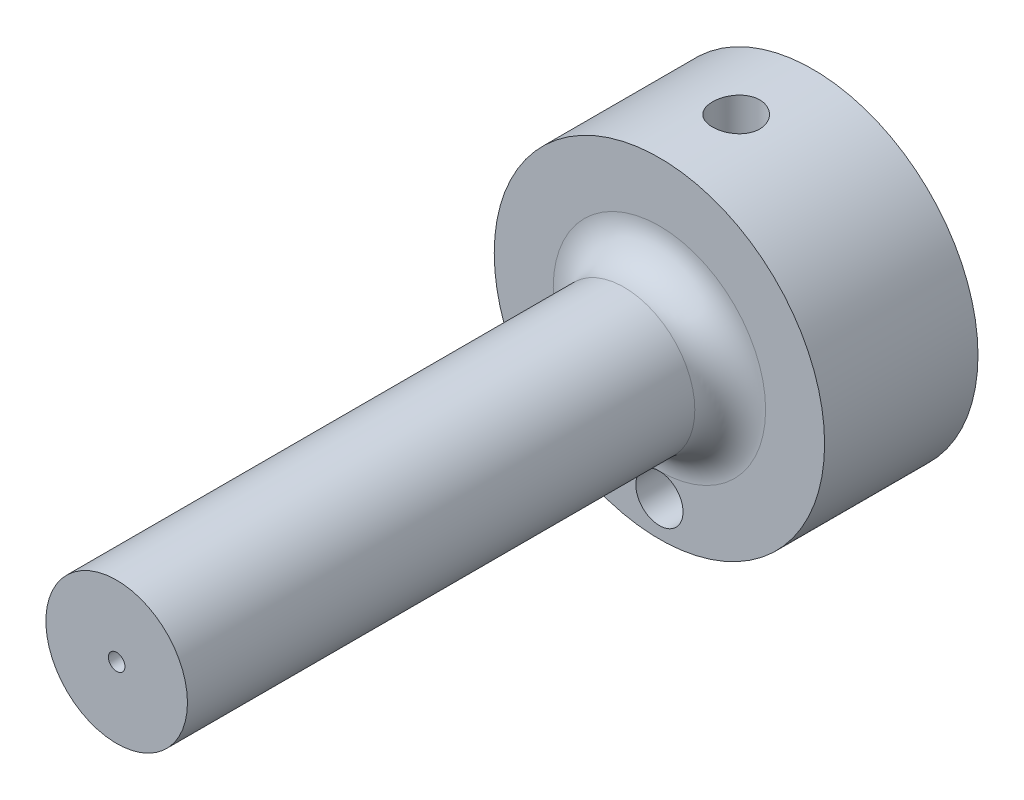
from build123d import *


with BuildPart() as part:
    # Sketch1 → Revolve1 (revolve)
    with BuildSketch(Plane(origin=(0, 0, 0), x_dir=(0, 0, -1), z_dir=(1, 0, 0)), mode=Mode.PRIVATE) as revolve1_sk:
        with BuildLine():
            Line((-46, 0.7), (13, 0.7))
            Line((13, 0.7), (13, 14))
            Line((13, 14), (0, 14))
            Line((0, 14), (0, 9))
            ThreePointArc((0, 9), (-0.878679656, 6.878679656), (-3, 6))
            Line((-3, 6), (-46, 6))
            Line((-46, 6), (-46, 0.7))
        make_face()
    revolve(revolve1_sk.sketch.rotate(Axis((0, 0, 46), (0, 0, -1)), 90), axis=Axis((0, 0, 46), (0, 0, -1)))

    # Sketch2 → Cut-Revolve1 (revolve, cut)
    with BuildSketch(Plane(origin=(0, 0, 0), x_dir=(0, 0, -1), z_dir=(1, 0, 0)), mode=Mode.PRIVATE) as cut_revolve1_sk:
        Polygon((8.5, 14), (6.5, 14), (6.5, 6.798278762), (8.5, 8), align=None)
    revolve(cut_revolve1_sk.sketch.rotate(Axis((0, 14, -6.5), (0, -1, 0)), 180), axis=Axis((0, 14, -6.5), (0, -1, 0)), mode=Mode.SUBTRACT)

    # Sketch3 → Cut-Revolve2 (revolve, cut)
    with BuildSketch(Plane(origin=(0, -17.5, -14), x_dir=(0, 1, 0), z_dir=(1, 0, 0)), mode=Mode.PRIVATE) as cut_revolve2_sk:
        Polygon((8.5, 14), (6.5, 14), (6.5, 6.798278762), (8.5, 8), align=None)
    revolve(cut_revolve2_sk.sketch.rotate(Axis((0, -11, 0), (0, 0, -1)), 90), axis=Axis((0, -11, 0), (0, 0, -1)), mode=Mode.SUBTRACT)


solid = part.part
